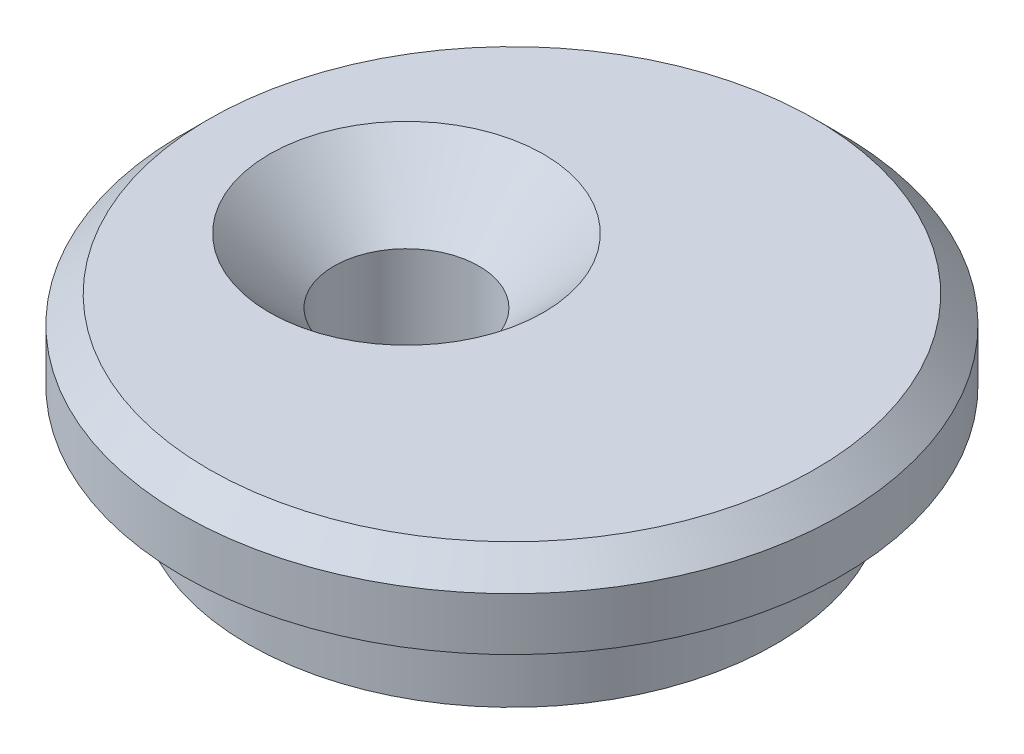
from build123d import *

# Parameters (mm, degrees)
SKETCH1_R                                           = 10
EXTRUDE1_DEPTH                                      = 3.5
SKETCH2_R                                           = 12.5
EXTRUDE2_DEPTH                                      = 3
CHAMFER1_SIZE                                       = 1
CSK_FOR_M5_COUNTERSUNK_FLAT_HEAD_SCREW1_D           = 5.5
CSK_FOR_M5_COUNTERSUNK_FLAT_HEAD_SCREW1_CSINK_D     = 10.4
CSK_FOR_M5_COUNTERSUNK_FLAT_HEAD_SCREW1_CSINK_ANGLE = 90


with BuildPart() as part:
    # Sketch1 → Extrude1 (new body)
    with BuildSketch(Plane(origin=(0, 0, 0), x_dir=(1, 0, 0), z_dir=(0, 1, 0))):
        with Locations(Location((0, 0, 0), (0, 0, 270))):
            Circle(SKETCH1_R)
    extrude(amount=EXTRUDE1_DEPTH)

    # Sketch2 → Extrude2 (add)
    with BuildSketch(Plane(origin=(0, 3.5, 0), x_dir=(1, 0, 0), z_dir=(0, 1, 0))):
        with Locations(Location((0, 0, 0), (0, 0, 270))):
            Circle(SKETCH2_R)
    extrude(amount=EXTRUDE2_DEPTH)

    # Chamfer1
    chamfer1_edges = [part.edges().sort_by_distance(p)[0] for p in [
        (0, 6.5, -12.5),
    ]]
    chamfer(chamfer1_edges, length=CHAMFER1_SIZE)

    # CSK for M5 Countersunk Flat Head Screw1 (through all)
    with Locations(Plane(origin=(-4, 6.5, 0), x_dir=(0, 0, 1), z_dir=(0, 1, 0))):
        with Locations((0, 0)):
            CounterSinkHole(CSK_FOR_M5_COUNTERSUNK_FLAT_HEAD_SCREW1_D / 2, CSK_FOR_M5_COUNTERSUNK_FLAT_HEAD_SCREW1_CSINK_D / 2, counter_sink_angle=CSK_FOR_M5_COUNTERSUNK_FLAT_HEAD_SCREW1_CSINK_ANGLE)


solid = part.part
